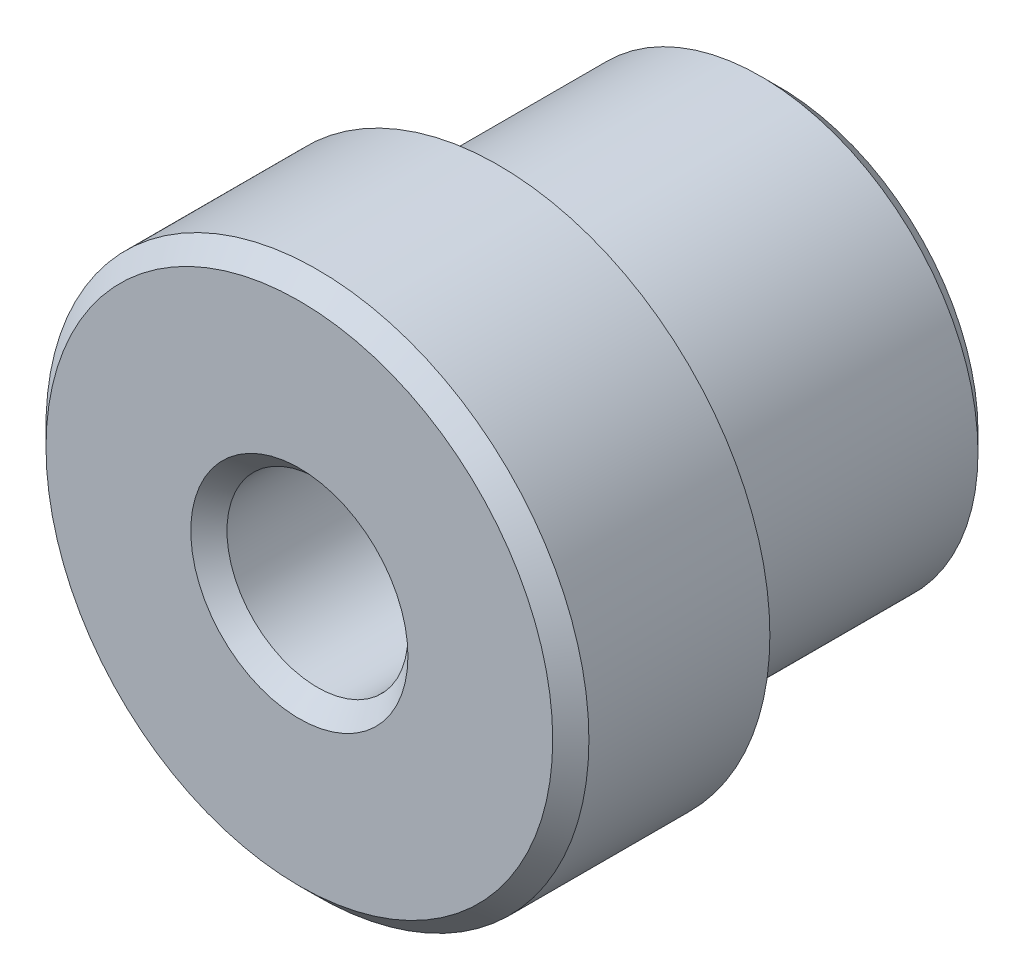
from build123d import *

# Parameters (mm, degrees)
ESQUISSE1_R        = 12
ESQUISSE1_R_2      = 5
BOSS_EXTRU_1_DEPTH = 15.5
ESQUISSE2_R        = 15
ESQUISSE2_R_2      = 5
BOSS_EXTRU_2_DEPTH = 11
CHANFREIN1_SIZE    = 1


with BuildPart() as part:
    # Esquisse1 → Boss.-Extru.1 (new body)
    with BuildSketch(Plane.XY):
        Circle(ESQUISSE1_R)
        Circle(ESQUISSE1_R_2, mode=Mode.SUBTRACT)
    extrude(amount=BOSS_EXTRU_1_DEPTH)

    # Esquisse2 → Boss.-Extru.2 (add)
    with BuildSketch(Plane.XY.offset(15.5)):
        Circle(ESQUISSE2_R)
        Circle(ESQUISSE2_R_2, mode=Mode.SUBTRACT)
    extrude(amount=BOSS_EXTRU_2_DEPTH)

    # Chanfrein1
    chanfrein1_edges = [part.edges().sort_by_distance(p)[0] for p in [
        (-5, 0, 26.5),
        (-12, 0, 0),
        (-5, 0, 0),
        (-15, 0, 26.5),
    ]]
    chamfer(chanfrein1_edges, length=CHANFREIN1_SIZE)


solid = part.part
